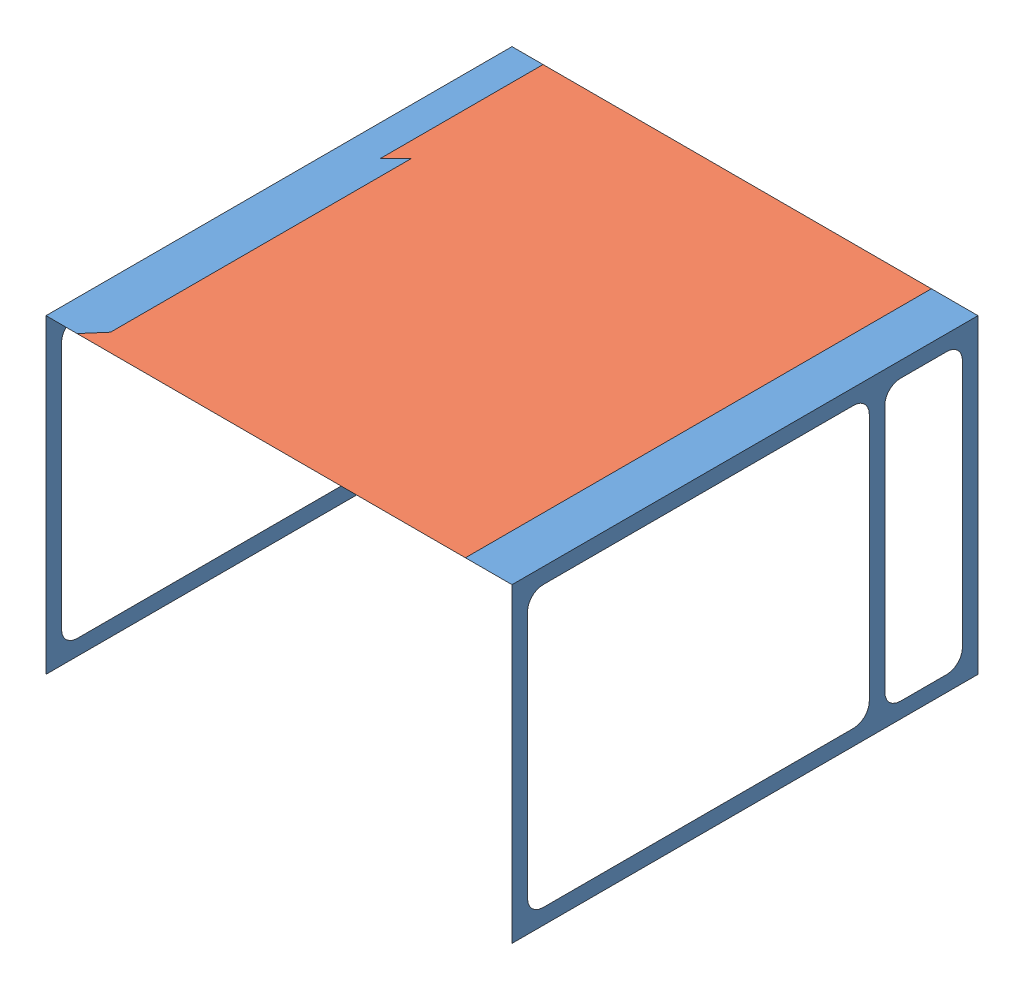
SolidWorks assembly Ensamblaje1.SLDASM, configuration Default (file format 4400). Lengths in mm.
Overall size (300 200 312.05).
2 component instances, 2 part files, 4 mates.
Components (placement in the parent):
- Pieza1-1: Pieza1.SLDPRT [Default] at (77.6435 81.3266 -90.4876) size (300 200 300)
- Pieza2-1: Pieza2.SLDPRT [Default] at (-3.551 138.7184 -90.4876) size (260 0 300)
Mates (geometry in assembly coordinates):
- Coincidente1: coincident aligned: plane of Pieza1-1 through (-72.3565 138.7184 -90.4876) normal (0 -1 0); plane of Pieza2-1 through (-52.3565 138.7184 -90.4876) normal (0 -1 0)
- Distancia1: distance = 20 mm: line of Pieza2-1 through (-52.3565 138.7184 209.5124) axis (0 0 -1); plane of Pieza1-1 through (-72.3565 -61.2816 -90.4876) normal (1 0 0)
- Coincidente4: coincident aligned: line of Pieza1-1 through (-72.3565 138.7184 -90.4876) axis (1 0 0); line of Pieza2-1 through (-52.3565 138.7184 -90.4876) axis (1 0 0); sketch_entity of Pieza1-1; line of Pieza2-1 through (207.6435 138.7184 209.5124) axis (-1 0 0)
- Croquis2: unknown: line of Pieza1-1 through (227.6435 138.7184 -90.4876) axis (0 0 1); plane of Pieza1-1 through (227.6435 138.7184 -90.4876) normal (0 1 0); face of Pieza2-1; point of Pieza2-1; edge_curve of Pieza2-1; edge_curve of Pieza2-1; edge_curve of Pieza2-1; edge_curve of Pieza2-1; edge_curve of Pieza2-1; edge_curve of Pieza1-1; edge_curve of Pieza1-1; edge_curve of Pieza1-1; edge_curve of Pieza1-1; edge_curve of Pieza1-1; edge_curve of Pieza1-1
